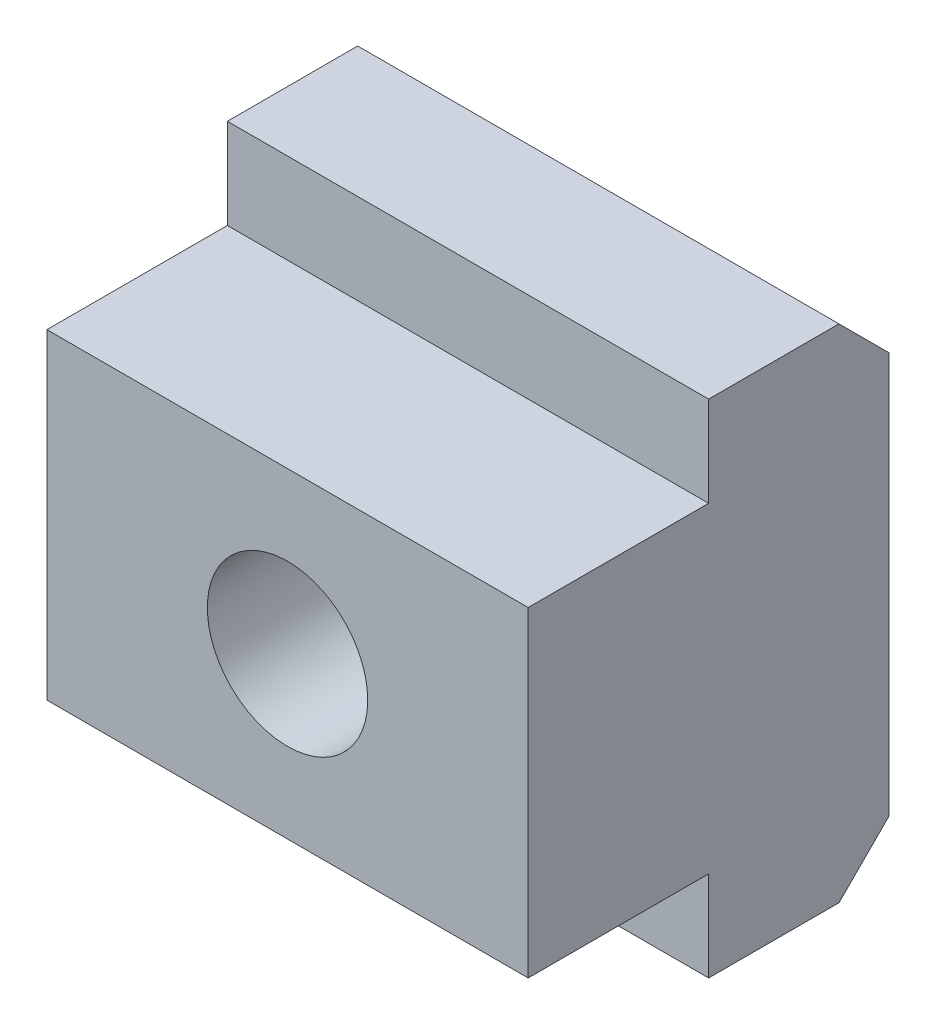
ISO-10303-21;
HEADER;
FILE_DESCRIPTION(('STEP AP214'),'2;1');
FILE_NAME('part.step','',(''),(''),'','','');
FILE_SCHEMA(('AUTOMOTIVE_DESIGN { 1 0 10303 214 1 1 1 1 }'));
ENDSEC;
DATA;
#1=APPLICATION_CONTEXT('core data for automotive mechanical design processes');
#2=APPLICATION_PROTOCOL_DEFINITION('international standard','automotive_design',2000,#1);
#3=PRODUCT_CONTEXT('',#1,'mechanical');
#4=PRODUCT('Part','Part','',(#3));
#5=PRODUCT_RELATED_PRODUCT_CATEGORY('part','',(#4));
#6=PRODUCT_DEFINITION_FORMATION('','',#4);
#7=PRODUCT_DEFINITION_CONTEXT('part definition',#1,'design');
#8=PRODUCT_DEFINITION('design','',#6,#7);
#9=PRODUCT_DEFINITION_SHAPE('','',#8);
#10=(LENGTH_UNIT() NAMED_UNIT(*) SI_UNIT(.MILLI.,.METRE.));
#11=(NAMED_UNIT(*) PLANE_ANGLE_UNIT() SI_UNIT($,.RADIAN.));
#12=(NAMED_UNIT(*) SI_UNIT($,.STERADIAN.) SOLID_ANGLE_UNIT());
#13=UNCERTAINTY_MEASURE_WITH_UNIT(LENGTH_MEASURE(1.E-05),#10,'distance_accuracy_value','');
#14=(GEOMETRIC_REPRESENTATION_CONTEXT(3) GLOBAL_UNCERTAINTY_ASSIGNED_CONTEXT((#13)) GLOBAL_UNIT_ASSIGNED_CONTEXT((#10,
#11,#12)) REPRESENTATION_CONTEXT('',''));
#15=CARTESIAN_POINT('',(0.,0.,0.));
#16=DIRECTION('',(0.,0.,1.));
#17=DIRECTION('',(1.,0.,0.));
#18=AXIS2_PLACEMENT_3D('',#15,#16,#17);
#19=CARTESIAN_POINT('',(12.,8.,0.));
#20=DIRECTION('',(0.,-1.,0.));
#21=DIRECTION('',(0.,0.,-1.));
#22=AXIS2_PLACEMENT_3D('',#19,#20,#21);
#23=PLANE('',#22);
#24=DIRECTION('',(0.,0.,1.));
#25=VECTOR('',#24,1.);
#26=CARTESIAN_POINT('',(-12.,8.,0.));
#27=LINE('',#26,#25);
#28=CARTESIAN_POINT('',(-12.,8.,0.));
#29=VERTEX_POINT('',#28);
#30=CARTESIAN_POINT('',(-12.,8.,9.0000000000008));
#31=VERTEX_POINT('',#30);
#32=EDGE_CURVE('E94',#29,#31,#27,.T.);
#33=ORIENTED_EDGE('',*,*,#32,.T.);
#34=DIRECTION('',(-1.,0.,0.));
#35=VECTOR('',#34,1.);
#36=CARTESIAN_POINT('',(12.,8.,9.0000000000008));
#37=LINE('',#36,#35);
#38=CARTESIAN_POINT('',(12.,8.,9.0000000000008));
#39=VERTEX_POINT('',#38);
#40=EDGE_CURVE('E9',#39,#31,#37,.T.);
#41=ORIENTED_EDGE('',*,*,#40,.F.);
#42=DIRECTION('',(0.,0.,1.));
#43=VECTOR('',#42,1.);
#44=CARTESIAN_POINT('',(12.,8.,0.));
#45=LINE('',#44,#43);
#46=CARTESIAN_POINT('',(12.,8.,0.));
#47=VERTEX_POINT('',#46);
#48=EDGE_CURVE('E130',#47,#39,#45,.T.);
#49=ORIENTED_EDGE('',*,*,#48,.F.);
#50=DIRECTION('',(-1.,0.,0.));
#51=VECTOR('',#50,1.);
#52=CARTESIAN_POINT('',(12.,8.,0.));
#53=LINE('',#52,#51);
#54=EDGE_CURVE('E107',#47,#29,#53,.T.);
#55=ORIENTED_EDGE('',*,*,#54,.T.);
#56=EDGE_LOOP('',(#33,#41,#49,#55));
#57=FACE_BOUND('',#56,.T.);
#58=ADVANCED_FACE('F14',(#57),#23,.F.);
#59=CARTESIAN_POINT('',(12.,8.,9.0000000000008));
#60=DIRECTION('',(0.,0.,-1.));
#61=DIRECTION('',(0.,1.,0.));
#62=AXIS2_PLACEMENT_3D('',#59,#60,#61);
#63=PLANE('',#62);
#64=CARTESIAN_POINT('',(0.,0.,9.0000000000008));
#65=DIRECTION('',(0.,0.,1.));
#66=DIRECTION('',(1.,0.,0.));
#67=AXIS2_PLACEMENT_3D('',#64,#65,#66);
#68=CIRCLE('',#67,4.);
#69=CARTESIAN_POINT('',(4.,0.,9.0000000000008));
#70=VERTEX_POINT('',#69);
#71=EDGE_CURVE('E108',#70,#70,#68,.T.);
#72=ORIENTED_EDGE('',*,*,#71,.F.);
#73=EDGE_LOOP('',(#72));
#74=FACE_BOUND('',#73,.T.);
#75=DIRECTION('',(0.,-1.,0.));
#76=VECTOR('',#75,1.);
#77=CARTESIAN_POINT('',(-12.,8.,9.0000000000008));
#78=LINE('',#77,#76);
#79=CARTESIAN_POINT('',(-12.,-8.,9.0000000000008));
#80=VERTEX_POINT('',#79);
#81=EDGE_CURVE('E90',#31,#80,#78,.T.);
#82=ORIENTED_EDGE('',*,*,#81,.T.);
#83=DIRECTION('',(-1.,0.,0.));
#84=VECTOR('',#83,1.);
#85=CARTESIAN_POINT('',(12.,-8.,9.0000000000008));
#86=LINE('',#85,#84);
#87=CARTESIAN_POINT('',(12.,-8.,9.0000000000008));
#88=VERTEX_POINT('',#87);
#89=EDGE_CURVE('E21',#88,#80,#86,.T.);
#90=ORIENTED_EDGE('',*,*,#89,.F.);
#91=DIRECTION('',(0.,-1.,0.));
#92=VECTOR('',#91,1.);
#93=CARTESIAN_POINT('',(12.,8.,9.0000000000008));
#94=LINE('',#93,#92);
#95=EDGE_CURVE('E103',#39,#88,#94,.T.);
#96=ORIENTED_EDGE('',*,*,#95,.F.);
#97=ORIENTED_EDGE('',*,*,#40,.T.);
#98=EDGE_LOOP('',(#82,#90,#96,#97));
#99=FACE_BOUND('',#98,.T.);
#100=ADVANCED_FACE('F102',(#74,#99),#63,.F.);
#101=CARTESIAN_POINT('',(12.,-8.,9.0000000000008));
#102=DIRECTION('',(0.,1.,0.));
#103=DIRECTION('',(0.,0.,1.));
#104=AXIS2_PLACEMENT_3D('',#101,#102,#103);
#105=PLANE('',#104);
#106=DIRECTION('',(0.,0.,-1.));
#107=VECTOR('',#106,1.);
#108=CARTESIAN_POINT('',(-12.,-8.,9.0000000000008));
#109=LINE('',#108,#107);
#110=CARTESIAN_POINT('',(-12.,-7.99999999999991,7.99707522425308E-13));
#111=VERTEX_POINT('',#110);
#112=EDGE_CURVE('E96',#80,#111,#109,.T.);
#113=ORIENTED_EDGE('',*,*,#112,.T.);
#114=DIRECTION('',(-1.,0.,0.));
#115=VECTOR('',#114,1.);
#116=CARTESIAN_POINT('',(12.,-7.99999999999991,7.99707522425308E-13));
#117=LINE('',#116,#115);
#118=CARTESIAN_POINT('',(12.,-7.99999999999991,7.99707522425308E-13));
#119=VERTEX_POINT('',#118);
#120=EDGE_CURVE('E166',#119,#111,#117,.T.);
#121=ORIENTED_EDGE('',*,*,#120,.F.);
#122=DIRECTION('',(0.,0.,-1.));
#123=VECTOR('',#122,1.);
#124=CARTESIAN_POINT('',(12.,-8.,9.0000000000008));
#125=LINE('',#124,#123);
#126=EDGE_CURVE('E133',#88,#119,#125,.T.);
#127=ORIENTED_EDGE('',*,*,#126,.F.);
#128=ORIENTED_EDGE('',*,*,#89,.T.);
#129=EDGE_LOOP('',(#113,#121,#127,#128));
#130=FACE_BOUND('',#129,.T.);
#131=ADVANCED_FACE('F170',(#130),#105,.F.);
#132=CARTESIAN_POINT('',(12.,-7.99999999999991,7.99707522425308E-13));
#133=DIRECTION('',(0.,0.,-1.));
#134=DIRECTION('',(0.,1.,0.));
#135=AXIS2_PLACEMENT_3D('',#132,#133,#134);
#136=PLANE('',#135);
#137=DIRECTION('',(0.,-1.,0.));
#138=VECTOR('',#137,1.);
#139=CARTESIAN_POINT('',(-12.,-7.99999999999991,7.99707522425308E-13));
#140=LINE('',#139,#138);
#141=CARTESIAN_POINT('',(-12.,-12.4999999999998,6.71337985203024E-13));
#142=VERTEX_POINT('',#141);
#143=EDGE_CURVE('E116',#111,#142,#140,.T.);
#144=ORIENTED_EDGE('',*,*,#143,.T.);
#145=DIRECTION('',(-1.,0.,0.));
#146=VECTOR('',#145,1.);
#147=CARTESIAN_POINT('',(12.,-12.4999999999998,6.71337985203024E-13));
#148=LINE('',#147,#146);
#149=CARTESIAN_POINT('',(12.,-12.4999999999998,6.71337985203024E-13));
#150=VERTEX_POINT('',#149);
#151=EDGE_CURVE('E163',#150,#142,#148,.T.);
#152=ORIENTED_EDGE('',*,*,#151,.F.);
#153=DIRECTION('',(0.,-1.,0.));
#154=VECTOR('',#153,1.);
#155=CARTESIAN_POINT('',(12.,-7.99999999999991,7.99707522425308E-13));
#156=LINE('',#155,#154);
#157=EDGE_CURVE('E135',#119,#150,#156,.T.);
#158=ORIENTED_EDGE('',*,*,#157,.F.);
#159=ORIENTED_EDGE('',*,*,#120,.T.);
#160=EDGE_LOOP('',(#144,#152,#158,#159));
#161=FACE_BOUND('',#160,.T.);
#162=ADVANCED_FACE('F178',(#161),#136,.F.);
#163=CARTESIAN_POINT('',(12.,-12.4999999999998,6.71337985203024E-13));
#164=DIRECTION('',(0.,1.,0.));
#165=DIRECTION('',(0.,0.,1.));
#166=AXIS2_PLACEMENT_3D('',#163,#164,#165);
#167=PLANE('',#166);
#168=DIRECTION('',(0.,0.,-1.));
#169=VECTOR('',#168,1.);
#170=CARTESIAN_POINT('',(-12.,-12.4999999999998,6.71337985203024E-13));
#171=LINE('',#170,#169);
#172=CARTESIAN_POINT('',(-12.,-12.4999999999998,-6.49999999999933));
#173=VERTEX_POINT('',#172);
#174=EDGE_CURVE('E118',#142,#173,#171,.T.);
#175=ORIENTED_EDGE('',*,*,#174,.T.);
#176=DIRECTION('',(-1.,0.,0.));
#177=VECTOR('',#176,1.);
#178=CARTESIAN_POINT('',(12.,-12.4999999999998,-6.49999999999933));
#179=LINE('',#178,#177);
#180=CARTESIAN_POINT('',(12.,-12.4999999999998,-6.49999999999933));
#181=VERTEX_POINT('',#180);
#182=EDGE_CURVE('E160',#181,#173,#179,.T.);
#183=ORIENTED_EDGE('',*,*,#182,.F.);
#184=DIRECTION('',(0.,0.,-1.));
#185=VECTOR('',#184,1.);
#186=CARTESIAN_POINT('',(12.,-12.4999999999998,6.71337985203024E-13));
#187=LINE('',#186,#185);
#188=EDGE_CURVE('E137',#150,#181,#187,.T.);
#189=ORIENTED_EDGE('',*,*,#188,.F.);
#190=ORIENTED_EDGE('',*,*,#151,.T.);
#191=EDGE_LOOP('',(#175,#183,#189,#190));
#192=FACE_BOUND('',#191,.T.);
#193=ADVANCED_FACE('F181',(#192),#167,.F.);
#194=CARTESIAN_POINT('',(12.,-12.4999999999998,-6.49999999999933));
#195=DIRECTION('',(0.,0.70710678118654,0.707106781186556));
#196=DIRECTION('',(0.,-0.707106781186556,0.70710678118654));
#197=AXIS2_PLACEMENT_3D('',#194,#195,#196);
#198=PLANE('',#197);
#199=DIRECTION('',(0.,0.707106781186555,-0.70710678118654));
#200=VECTOR('',#199,1.);
#201=CARTESIAN_POINT('',(-12.,-12.4999999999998,-6.49999999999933));
#202=LINE('',#201,#200);
#203=CARTESIAN_POINT('',(-12.,-9.99999999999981,-8.99999999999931));
#204=VERTEX_POINT('',#203);
#205=EDGE_CURVE('E120',#173,#204,#202,.T.);
#206=ORIENTED_EDGE('',*,*,#205,.T.);
#207=DIRECTION('',(-1.,0.,0.));
#208=VECTOR('',#207,1.);
#209=CARTESIAN_POINT('',(12.,-9.99999999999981,-8.99999999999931));
#210=LINE('',#209,#208);
#211=CARTESIAN_POINT('',(12.,-9.99999999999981,-8.99999999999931));
#212=VERTEX_POINT('',#211);
#213=EDGE_CURVE('E157',#212,#204,#210,.T.);
#214=ORIENTED_EDGE('',*,*,#213,.F.);
#215=DIRECTION('',(0.,0.707106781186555,-0.70710678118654));
#216=VECTOR('',#215,1.);
#217=CARTESIAN_POINT('',(12.,-12.4999999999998,-6.49999999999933));
#218=LINE('',#217,#216);
#219=EDGE_CURVE('E139',#181,#212,#218,.T.);
#220=ORIENTED_EDGE('',*,*,#219,.F.);
#221=ORIENTED_EDGE('',*,*,#182,.T.);
#222=EDGE_LOOP('',(#206,#214,#220,#221));
#223=FACE_BOUND('',#222,.T.);
#224=ADVANCED_FACE('F186',(#223),#198,.F.);
#225=CARTESIAN_POINT('',(12.,-9.99999999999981,-8.99999999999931));
#226=DIRECTION('',(0.,0.,1.));
#227=DIRECTION('',(0.,-1.,0.));
#228=AXIS2_PLACEMENT_3D('',#225,#226,#227);
#229=PLANE('',#228);
#230=CARTESIAN_POINT('',(0.,0.,-8.99999999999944));
#231=DIRECTION('',(0.,0.,1.));
#232=DIRECTION('',(1.,0.,0.));
#233=AXIS2_PLACEMENT_3D('',#230,#231,#232);
#234=CIRCLE('',#233,4.);
#235=CARTESIAN_POINT('',(4.,0.,-8.99999999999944));
#236=VERTEX_POINT('',#235);
#237=EDGE_CURVE('E111',#236,#236,#234,.T.);
#238=ORIENTED_EDGE('',*,*,#237,.T.);
#239=EDGE_LOOP('',(#238));
#240=FACE_BOUND('',#239,.T.);
#241=DIRECTION('',(0.,1.,0.));
#242=VECTOR('',#241,1.);
#243=CARTESIAN_POINT('',(-12.,-9.99999999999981,-8.99999999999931));
#244=LINE('',#243,#242);
#245=CARTESIAN_POINT('',(-12.,10.0000000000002,-8.99999999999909));
#246=VERTEX_POINT('',#245);
#247=EDGE_CURVE('E122',#204,#246,#244,.T.);
#248=ORIENTED_EDGE('',*,*,#247,.T.);
#249=DIRECTION('',(-1.,0.,0.));
#250=VECTOR('',#249,1.);
#251=CARTESIAN_POINT('',(12.,10.0000000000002,-8.99999999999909));
#252=LINE('',#251,#250);
#253=CARTESIAN_POINT('',(12.,10.0000000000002,-8.99999999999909));
#254=VERTEX_POINT('',#253);
#255=EDGE_CURVE('E154',#254,#246,#252,.T.);
#256=ORIENTED_EDGE('',*,*,#255,.F.);
#257=DIRECTION('',(0.,1.,0.));
#258=VECTOR('',#257,1.);
#259=CARTESIAN_POINT('',(12.,-9.99999999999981,-8.99999999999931));
#260=LINE('',#259,#258);
#261=EDGE_CURVE('E141',#212,#254,#260,.T.);
#262=ORIENTED_EDGE('',*,*,#261,.F.);
#263=ORIENTED_EDGE('',*,*,#213,.T.);
#264=EDGE_LOOP('',(#248,#256,#262,#263));
#265=FACE_BOUND('',#264,.T.);
#266=ADVANCED_FACE('F192',(#240,#265),#229,.F.);
#267=CARTESIAN_POINT('',(12.,10.0000000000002,-8.99999999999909));
#268=DIRECTION('',(0.,-0.707106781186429,0.707106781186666));
#269=DIRECTION('',(0.,-0.707106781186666,-0.707106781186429));
#270=AXIS2_PLACEMENT_3D('',#267,#268,#269);
#271=PLANE('',#270);
#272=DIRECTION('',(0.,0.707106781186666,0.707106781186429));
#273=VECTOR('',#272,1.);
#274=CARTESIAN_POINT('',(-12.,10.0000000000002,-8.99999999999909));
#275=LINE('',#274,#273);
#276=CARTESIAN_POINT('',(-12.,12.5000000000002,-6.5));
#277=VERTEX_POINT('',#276);
#278=EDGE_CURVE('E124',#246,#277,#275,.T.);
#279=ORIENTED_EDGE('',*,*,#278,.T.);
#280=DIRECTION('',(-1.,0.,0.));
#281=VECTOR('',#280,1.);
#282=CARTESIAN_POINT('',(12.,12.5000000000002,-6.5));
#283=LINE('',#282,#281);
#284=CARTESIAN_POINT('',(12.,12.5000000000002,-6.5));
#285=VERTEX_POINT('',#284);
#286=EDGE_CURVE('E151',#285,#277,#283,.T.);
#287=ORIENTED_EDGE('',*,*,#286,.F.);
#288=DIRECTION('',(0.,0.707106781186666,0.707106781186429));
#289=VECTOR('',#288,1.);
#290=CARTESIAN_POINT('',(12.,10.0000000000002,-8.99999999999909));
#291=LINE('',#290,#289);
#292=EDGE_CURVE('E143',#254,#285,#291,.T.);
#293=ORIENTED_EDGE('',*,*,#292,.F.);
#294=ORIENTED_EDGE('',*,*,#255,.T.);
#295=EDGE_LOOP('',(#279,#287,#293,#294));
#296=FACE_BOUND('',#295,.T.);
#297=ADVANCED_FACE('F196',(#296),#271,.F.);
#298=CARTESIAN_POINT('',(12.,12.5000000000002,-6.5));
#299=DIRECTION('',(0.,-1.,0.));
#300=DIRECTION('',(1.,0.,0.));
#301=AXIS2_PLACEMENT_3D('',#298,#299,#300);
#302=PLANE('',#301);
#303=DIRECTION('',(0.,0.,1.));
#304=VECTOR('',#303,1.);
#305=CARTESIAN_POINT('',(-12.,12.5000000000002,-6.5));
#306=LINE('',#305,#304);
#307=CARTESIAN_POINT('',(-12.,12.5000000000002,0.));
#308=VERTEX_POINT('',#307);
#309=EDGE_CURVE('E126',#277,#308,#306,.T.);
#310=ORIENTED_EDGE('',*,*,#309,.T.);
#311=DIRECTION('',(-1.,0.,0.));
#312=VECTOR('',#311,1.);
#313=CARTESIAN_POINT('',(12.,12.5000000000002,0.));
#314=LINE('',#313,#312);
#315=CARTESIAN_POINT('',(12.,12.5000000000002,0.));
#316=VERTEX_POINT('',#315);
#317=EDGE_CURVE('E148',#316,#308,#314,.T.);
#318=ORIENTED_EDGE('',*,*,#317,.F.);
#319=DIRECTION('',(0.,0.,1.));
#320=VECTOR('',#319,1.);
#321=CARTESIAN_POINT('',(12.,12.5000000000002,-6.5));
#322=LINE('',#321,#320);
#323=EDGE_CURVE('E33',#285,#316,#322,.T.);
#324=ORIENTED_EDGE('',*,*,#323,.F.);
#325=ORIENTED_EDGE('',*,*,#286,.T.);
#326=EDGE_LOOP('',(#310,#318,#324,#325));
#327=FACE_BOUND('',#326,.T.);
#328=ADVANCED_FACE('F199',(#327),#302,.F.);
#329=CARTESIAN_POINT('',(12.,12.5000000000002,0.));
#330=DIRECTION('',(0.,0.,-1.));
#331=DIRECTION('',(-1.,0.,0.));
#332=AXIS2_PLACEMENT_3D('',#329,#330,#331);
#333=PLANE('',#332);
#334=DIRECTION('',(0.,-1.,0.));
#335=VECTOR('',#334,1.);
#336=CARTESIAN_POINT('',(-12.,12.5000000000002,0.));
#337=LINE('',#336,#335);
#338=EDGE_CURVE('E128',#308,#29,#337,.T.);
#339=ORIENTED_EDGE('',*,*,#338,.T.);
#340=ORIENTED_EDGE('',*,*,#54,.F.);
#341=DIRECTION('',(0.,-1.,0.));
#342=VECTOR('',#341,1.);
#343=CARTESIAN_POINT('',(12.,12.5000000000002,0.));
#344=LINE('',#343,#342);
#345=EDGE_CURVE('E28',#316,#47,#344,.T.);
#346=ORIENTED_EDGE('',*,*,#345,.F.);
#347=ORIENTED_EDGE('',*,*,#317,.T.);
#348=EDGE_LOOP('',(#339,#340,#346,#347));
#349=FACE_BOUND('',#348,.T.);
#350=ADVANCED_FACE('F201',(#349),#333,.F.);
#351=CARTESIAN_POINT('',(12.,8.,0.));
#352=DIRECTION('',(1.,0.,0.));
#353=DIRECTION('',(0.,1.,0.));
#354=AXIS2_PLACEMENT_3D('',#351,#352,#353);
#355=PLANE('',#354);
#356=ORIENTED_EDGE('',*,*,#48,.T.);
#357=ORIENTED_EDGE('',*,*,#95,.T.);
#358=ORIENTED_EDGE('',*,*,#126,.T.);
#359=ORIENTED_EDGE('',*,*,#157,.T.);
#360=ORIENTED_EDGE('',*,*,#188,.T.);
#361=ORIENTED_EDGE('',*,*,#219,.T.);
#362=ORIENTED_EDGE('',*,*,#261,.T.);
#363=ORIENTED_EDGE('',*,*,#292,.T.);
#364=ORIENTED_EDGE('',*,*,#323,.T.);
#365=ORIENTED_EDGE('',*,*,#345,.T.);
#366=EDGE_LOOP('',(#356,#357,#358,#359,#360,#361,#362,#363,#364,#365));
#367=FACE_BOUND('',#366,.T.);
#368=ADVANCED_FACE('F173',(#367),#355,.T.);
#369=CARTESIAN_POINT('',(-12.,8.,0.));
#370=DIRECTION('',(1.,0.,0.));
#371=DIRECTION('',(0.,1.,0.));
#372=AXIS2_PLACEMENT_3D('',#369,#370,#371);
#373=PLANE('',#372);
#374=ORIENTED_EDGE('',*,*,#32,.F.);
#375=ORIENTED_EDGE('',*,*,#338,.F.);
#376=ORIENTED_EDGE('',*,*,#309,.F.);
#377=ORIENTED_EDGE('',*,*,#278,.F.);
#378=ORIENTED_EDGE('',*,*,#247,.F.);
#379=ORIENTED_EDGE('',*,*,#205,.F.);
#380=ORIENTED_EDGE('',*,*,#174,.F.);
#381=ORIENTED_EDGE('',*,*,#143,.F.);
#382=ORIENTED_EDGE('',*,*,#112,.F.);
#383=ORIENTED_EDGE('',*,*,#81,.F.);
#384=EDGE_LOOP('',(#374,#375,#376,#377,#378,#379,#380,#381,#382,#383));
#385=FACE_BOUND('',#384,.T.);
#386=ADVANCED_FACE('F91',(#385),#373,.F.);
#387=CARTESIAN_POINT('',(0.,0.,9.0000000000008));
#388=DIRECTION('',(0.,0.,1.));
#389=DIRECTION('',(1.,0.,0.));
#390=AXIS2_PLACEMENT_3D('',#387,#388,#389);
#391=CYLINDRICAL_SURFACE('',#390,4.);
#392=ORIENTED_EDGE('',*,*,#237,.F.);
#393=EDGE_LOOP('',(#392));
#394=FACE_BOUND('',#393,.T.);
#395=ORIENTED_EDGE('',*,*,#71,.T.);
#396=EDGE_LOOP('',(#395));
#397=FACE_BOUND('',#396,.T.);
#398=ADVANCED_FACE('F305',(#394,#397),#391,.F.);
#399=CLOSED_SHELL('',(#58,#100,#131,#162,#193,#224,#266,#297,#328,#350,#368,#386,#398));
#400=MANIFOLD_SOLID_BREP('B1',#399);
#401=ADVANCED_BREP_SHAPE_REPRESENTATION('',(#18,#400),#14);
#402=SHAPE_DEFINITION_REPRESENTATION(#9,#401);
ENDSEC;
END-ISO-10303-21;
